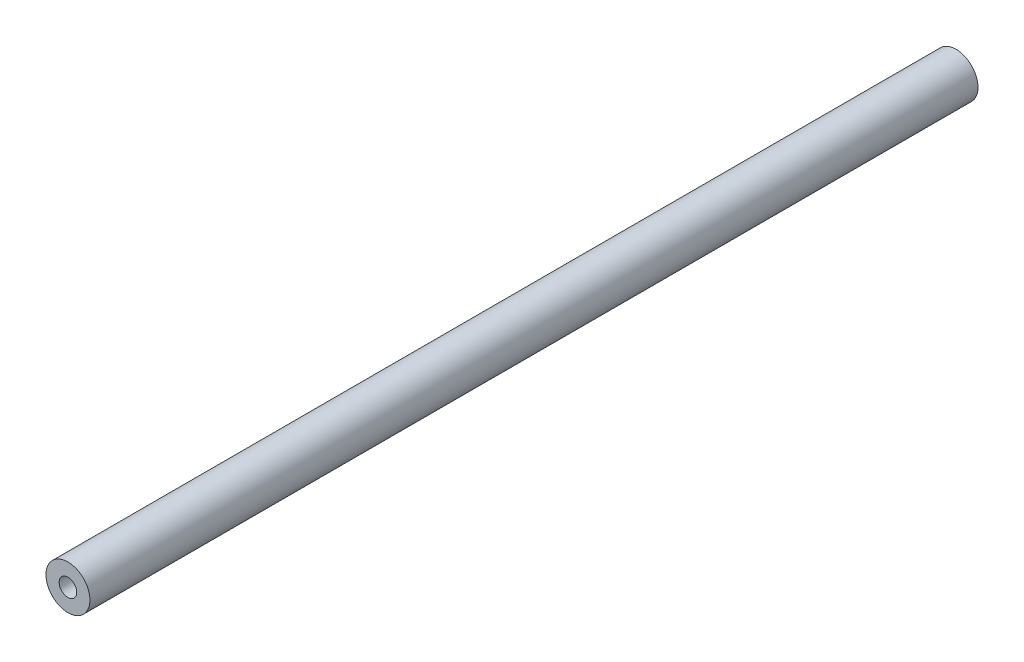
from build123d import *

# Parameters (mm, degrees)
SKETCH1_R           = 5
BOSS_EXTRUDE1_DEPTH = 202
SKETCH2_R           = 2
CUT_EXTRUDE1_DEPTH  = 25
CUT_EXTRUDE2_START  = -25
SKETCH3_R           = 2
CUT_EXTRUDE2_DEPTH  = 25


with BuildPart() as part:
    # Sketch1 → Boss-Extrude1 (new body)
    with BuildSketch(Plane.XY):
        Circle(SKETCH1_R)
    extrude(amount=BOSS_EXTRUDE1_DEPTH)

    # Sketch2 → Cut-Extrude1 (cut)
    with BuildSketch(Plane.XY.offset(202)):
        Circle(SKETCH2_R)
    extrude(amount=-CUT_EXTRUDE1_DEPTH, mode=Mode.SUBTRACT)

    # Sketch3 → Cut-Extrude2 (cut)
    with BuildSketch(Plane(origin=(0, 0, 0), x_dir=(-1, 0, 0), z_dir=(0, 0, -1)).offset(CUT_EXTRUDE2_START)):
        with Locations(Location((0, 0, 0), (0, 0, 180))):
            Circle(SKETCH3_R)
    extrude(amount=CUT_EXTRUDE2_DEPTH, mode=Mode.SUBTRACT)


solid = part.part
